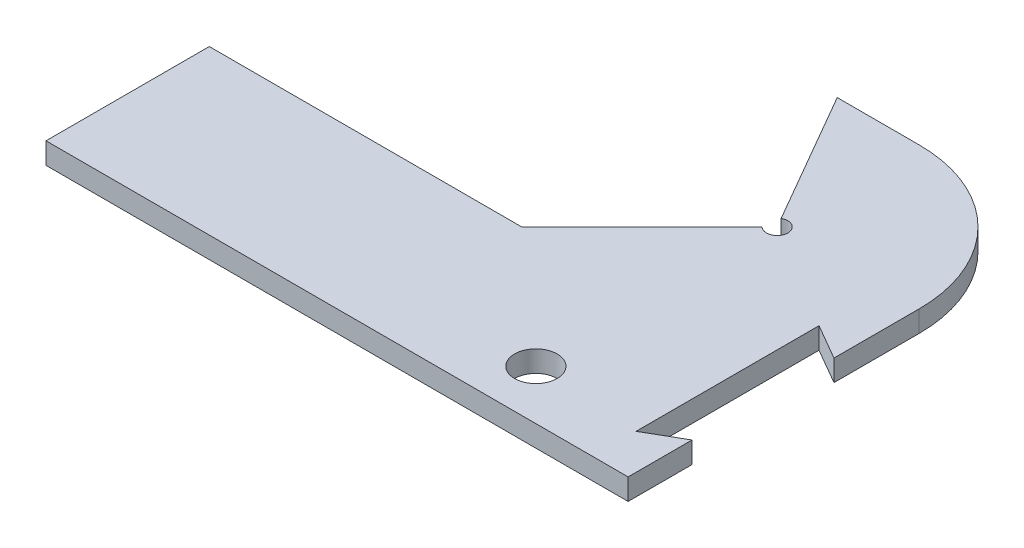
ISO-10303-21;
HEADER;
FILE_DESCRIPTION(('STEP AP214'),'2;1');
FILE_NAME('part.step','',(''),(''),'','','');
FILE_SCHEMA(('AUTOMOTIVE_DESIGN { 1 0 10303 214 1 1 1 1 }'));
ENDSEC;
DATA;
#1=APPLICATION_CONTEXT('core data for automotive mechanical design processes');
#2=APPLICATION_PROTOCOL_DEFINITION('international standard','automotive_design',2000,#1);
#3=PRODUCT_CONTEXT('',#1,'mechanical');
#4=PRODUCT('Part','Part','',(#3));
#5=PRODUCT_RELATED_PRODUCT_CATEGORY('part','',(#4));
#6=PRODUCT_DEFINITION_FORMATION('','',#4);
#7=PRODUCT_DEFINITION_CONTEXT('part definition',#1,'design');
#8=PRODUCT_DEFINITION('design','',#6,#7);
#9=PRODUCT_DEFINITION_SHAPE('','',#8);
#10=(LENGTH_UNIT() NAMED_UNIT(*) SI_UNIT(.MILLI.,.METRE.));
#11=(NAMED_UNIT(*) PLANE_ANGLE_UNIT() SI_UNIT($,.RADIAN.));
#12=(NAMED_UNIT(*) SI_UNIT($,.STERADIAN.) SOLID_ANGLE_UNIT());
#13=UNCERTAINTY_MEASURE_WITH_UNIT(LENGTH_MEASURE(1.E-05),#10,'distance_accuracy_value','');
#14=(GEOMETRIC_REPRESENTATION_CONTEXT(3) GLOBAL_UNCERTAINTY_ASSIGNED_CONTEXT((#13)) GLOBAL_UNIT_ASSIGNED_CONTEXT((#10,
#11,#12)) REPRESENTATION_CONTEXT('',''));
#15=CARTESIAN_POINT('',(0.,0.,0.));
#16=DIRECTION('',(0.,0.,1.));
#17=DIRECTION('',(1.,0.,0.));
#18=AXIS2_PLACEMENT_3D('',#15,#16,#17);
#19=CARTESIAN_POINT('',(62.,3.,-41.));
#20=DIRECTION('',(0.,1.,0.));
#21=DIRECTION('',(0.,0.,1.));
#22=AXIS2_PLACEMENT_3D('',#19,#20,#21);
#23=PLANE('',#22);
#24=DIRECTION('',(0.,0.,1.));
#25=VECTOR('',#24,1.);
#26=CARTESIAN_POINT('',(0.,3.,0.));
#27=LINE('',#26,#25);
#28=CARTESIAN_POINT('',(0.,3.,-23.));
#29=VERTEX_POINT('',#28);
#30=CARTESIAN_POINT('',(0.,3.,0.));
#31=VERTEX_POINT('',#30);
#32=EDGE_CURVE('E172',#29,#31,#27,.T.);
#33=ORIENTED_EDGE('',*,*,#32,.T.);
#34=DIRECTION('',(1.,0.,0.));
#35=VECTOR('',#34,1.);
#36=CARTESIAN_POINT('',(0.,3.,0.));
#37=LINE('',#36,#35);
#38=CARTESIAN_POINT('',(82.,3.,0.));
#39=VERTEX_POINT('',#38);
#40=EDGE_CURVE('E139',#31,#39,#37,.T.);
#41=ORIENTED_EDGE('',*,*,#40,.T.);
#42=DIRECTION('',(0.,0.,-1.));
#43=VECTOR('',#42,1.);
#44=CARTESIAN_POINT('',(82.,3.,0.));
#45=LINE('',#44,#43);
#46=CARTESIAN_POINT('',(82.,3.,-9.));
#47=VERTEX_POINT('',#46);
#48=EDGE_CURVE('E175',#39,#47,#45,.T.);
#49=ORIENTED_EDGE('',*,*,#48,.T.);
#50=DIRECTION('',(-0.866025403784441,0.,0.499999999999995));
#51=VECTOR('',#50,1.);
#52=CARTESIAN_POINT('',(82.,3.,-9.));
#53=LINE('',#52,#51);
#54=CARTESIAN_POINT('',(77.,3.,-6.11324865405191));
#55=VERTEX_POINT('',#54);
#56=EDGE_CURVE('E177',#47,#55,#53,.T.);
#57=ORIENTED_EDGE('',*,*,#56,.T.);
#58=DIRECTION('',(0.,0.,-1.));
#59=VECTOR('',#58,1.);
#60=CARTESIAN_POINT('',(77.,3.,-6.11324865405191));
#61=LINE('',#60,#59);
#62=CARTESIAN_POINT('',(77.,3.,-31.8867513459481));
#63=VERTEX_POINT('',#62);
#64=EDGE_CURVE('E179',#55,#63,#61,.T.);
#65=ORIENTED_EDGE('',*,*,#64,.T.);
#66=DIRECTION('',(0.866025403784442,0.,0.499999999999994));
#67=VECTOR('',#66,1.);
#68=CARTESIAN_POINT('',(82.,3.,-29.));
#69=LINE('',#68,#67);
#70=CARTESIAN_POINT('',(82.,3.,-29.));
#71=VERTEX_POINT('',#70);
#72=EDGE_CURVE('E181',#63,#71,#69,.T.);
#73=ORIENTED_EDGE('',*,*,#72,.T.);
#74=DIRECTION('',(0.,0.,-1.));
#75=VECTOR('',#74,1.);
#76=CARTESIAN_POINT('',(82.,3.,-29.));
#77=LINE('',#76,#75);
#78=CARTESIAN_POINT('',(82.,3.,-41.));
#79=VERTEX_POINT('',#78);
#80=EDGE_CURVE('E183',#71,#79,#77,.T.);
#81=ORIENTED_EDGE('',*,*,#80,.T.);
#82=CARTESIAN_POINT('',(62.,3.,-41.));
#83=DIRECTION('',(0.,1.,0.));
#84=DIRECTION('',(0.,0.,1.));
#85=AXIS2_PLACEMENT_3D('',#82,#83,#84);
#86=CIRCLE('',#85,20.);
#87=CARTESIAN_POINT('',(62.,3.,-61.));
#88=VERTEX_POINT('',#87);
#89=EDGE_CURVE('E185',#79,#88,#86,.T.);
#90=ORIENTED_EDGE('',*,*,#89,.T.);
#91=DIRECTION('',(-1.,0.,0.));
#92=VECTOR('',#91,1.);
#93=CARTESIAN_POINT('',(50.4529946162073,3.,-61.));
#94=LINE('',#93,#92);
#95=CARTESIAN_POINT('',(50.4529946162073,3.,-61.));
#96=VERTEX_POINT('',#95);
#97=EDGE_CURVE('E187',#88,#96,#94,.T.);
#98=ORIENTED_EDGE('',*,*,#97,.T.);
#99=DIRECTION('',(0.500000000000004,0.,0.866025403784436));
#100=VECTOR('',#99,1.);
#101=CARTESIAN_POINT('',(61.25,3.,-42.2990381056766));
#102=LINE('',#101,#100);
#103=CARTESIAN_POINT('',(61.25,3.,-42.2990381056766));
#104=VERTEX_POINT('',#103);
#105=EDGE_CURVE('E189',#96,#104,#102,.T.);
#106=ORIENTED_EDGE('',*,*,#105,.T.);
#107=CARTESIAN_POINT('',(62.,3.,-41.));
#108=DIRECTION('',(0.,-1.,0.));
#109=DIRECTION('',(0.,0.,1.));
#110=AXIS2_PLACEMENT_3D('',#107,#108,#109);
#111=CIRCLE('',#110,1.5);
#112=CARTESIAN_POINT('',(60.9393398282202,3.,-39.9393398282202));
#113=VERTEX_POINT('',#112);
#114=EDGE_CURVE('E191',#104,#113,#111,.T.);
#115=ORIENTED_EDGE('',*,*,#114,.T.);
#116=DIRECTION('',(-0.707106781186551,0.,0.707106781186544));
#117=VECTOR('',#116,1.);
#118=CARTESIAN_POINT('',(60.9393398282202,3.,-39.9393398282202));
#119=LINE('',#118,#117);
#120=CARTESIAN_POINT('',(43.9999999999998,3.,-23.));
#121=VERTEX_POINT('',#120);
#122=EDGE_CURVE('E50',#113,#121,#119,.T.);
#123=ORIENTED_EDGE('',*,*,#122,.T.);
#124=DIRECTION('',(-1.,0.,0.));
#125=VECTOR('',#124,1.);
#126=CARTESIAN_POINT('',(0.,3.,-23.));
#127=LINE('',#126,#125);
#128=EDGE_CURVE('E45',#121,#29,#127,.T.);
#129=ORIENTED_EDGE('',*,*,#128,.T.);
#130=EDGE_LOOP('',(#33,#41,#49,#57,#65,#73,#81,#90,#98,#106,#115,#123,#129));
#131=FACE_BOUND('',#130,.T.);
#132=CARTESIAN_POINT('',(62.,3.,-7.));
#133=DIRECTION('',(0.,1.,0.));
#134=DIRECTION('',(0.,0.,1.));
#135=AXIS2_PLACEMENT_3D('',#132,#133,#134);
#136=CIRCLE('',#135,3.);
#137=CARTESIAN_POINT('',(62.,3.,-4.));
#138=VERTEX_POINT('',#137);
#139=EDGE_CURVE('E144',#138,#138,#136,.T.);
#140=ORIENTED_EDGE('',*,*,#139,.F.);
#141=EDGE_LOOP('',(#140));
#142=FACE_BOUND('',#141,.T.);
#143=ADVANCED_FACE('F30',(#131,#142),#23,.T.);
#144=CARTESIAN_POINT('',(62.,0.,-41.));
#145=DIRECTION('',(0.,1.,0.));
#146=DIRECTION('',(0.,0.,1.));
#147=AXIS2_PLACEMENT_3D('',#144,#145,#146);
#148=PLANE('',#147);
#149=DIRECTION('',(0.,0.,1.));
#150=VECTOR('',#149,1.);
#151=CARTESIAN_POINT('',(0.,0.,0.));
#152=LINE('',#151,#150);
#153=CARTESIAN_POINT('',(0.,0.,-23.));
#154=VERTEX_POINT('',#153);
#155=CARTESIAN_POINT('',(0.,0.,0.));
#156=VERTEX_POINT('',#155);
#157=EDGE_CURVE('E130',#154,#156,#152,.T.);
#158=ORIENTED_EDGE('',*,*,#157,.F.);
#159=DIRECTION('',(-1.,0.,0.));
#160=VECTOR('',#159,1.);
#161=CARTESIAN_POINT('',(0.,0.,-23.));
#162=LINE('',#161,#160);
#163=CARTESIAN_POINT('',(43.9999999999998,0.,-23.));
#164=VERTEX_POINT('',#163);
#165=EDGE_CURVE('E170',#164,#154,#162,.T.);
#166=ORIENTED_EDGE('',*,*,#165,.F.);
#167=DIRECTION('',(-0.707106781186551,0.,0.707106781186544));
#168=VECTOR('',#167,1.);
#169=CARTESIAN_POINT('',(60.9393398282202,0.,-39.9393398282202));
#170=LINE('',#169,#168);
#171=CARTESIAN_POINT('',(60.9393398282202,0.,-39.9393398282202));
#172=VERTEX_POINT('',#171);
#173=EDGE_CURVE('E168',#172,#164,#170,.T.);
#174=ORIENTED_EDGE('',*,*,#173,.F.);
#175=CARTESIAN_POINT('',(62.,0.,-41.));
#176=DIRECTION('',(0.,-1.,0.));
#177=DIRECTION('',(0.,0.,1.));
#178=AXIS2_PLACEMENT_3D('',#175,#176,#177);
#179=CIRCLE('',#178,1.5);
#180=CARTESIAN_POINT('',(61.25,0.,-42.2990381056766));
#181=VERTEX_POINT('',#180);
#182=EDGE_CURVE('E166',#181,#172,#179,.T.);
#183=ORIENTED_EDGE('',*,*,#182,.F.);
#184=DIRECTION('',(0.500000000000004,0.,0.866025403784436));
#185=VECTOR('',#184,1.);
#186=CARTESIAN_POINT('',(61.25,0.,-42.2990381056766));
#187=LINE('',#186,#185);
#188=CARTESIAN_POINT('',(50.4529946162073,0.,-61.));
#189=VERTEX_POINT('',#188);
#190=EDGE_CURVE('E164',#189,#181,#187,.T.);
#191=ORIENTED_EDGE('',*,*,#190,.F.);
#192=DIRECTION('',(-1.,0.,0.));
#193=VECTOR('',#192,1.);
#194=CARTESIAN_POINT('',(50.4529946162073,0.,-61.));
#195=LINE('',#194,#193);
#196=CARTESIAN_POINT('',(62.,0.,-61.));
#197=VERTEX_POINT('',#196);
#198=EDGE_CURVE('E162',#197,#189,#195,.T.);
#199=ORIENTED_EDGE('',*,*,#198,.F.);
#200=CARTESIAN_POINT('',(62.,0.,-41.));
#201=DIRECTION('',(0.,1.,0.));
#202=DIRECTION('',(0.,0.,1.));
#203=AXIS2_PLACEMENT_3D('',#200,#201,#202);
#204=CIRCLE('',#203,20.);
#205=CARTESIAN_POINT('',(82.,0.,-41.));
#206=VERTEX_POINT('',#205);
#207=EDGE_CURVE('E160',#206,#197,#204,.T.);
#208=ORIENTED_EDGE('',*,*,#207,.F.);
#209=DIRECTION('',(0.,0.,-1.));
#210=VECTOR('',#209,1.);
#211=CARTESIAN_POINT('',(82.,0.,-29.));
#212=LINE('',#211,#210);
#213=CARTESIAN_POINT('',(82.,0.,-29.));
#214=VERTEX_POINT('',#213);
#215=EDGE_CURVE('E158',#214,#206,#212,.T.);
#216=ORIENTED_EDGE('',*,*,#215,.F.);
#217=DIRECTION('',(0.866025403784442,0.,0.499999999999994));
#218=VECTOR('',#217,1.);
#219=CARTESIAN_POINT('',(82.,0.,-29.));
#220=LINE('',#219,#218);
#221=CARTESIAN_POINT('',(77.,0.,-31.8867513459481));
#222=VERTEX_POINT('',#221);
#223=EDGE_CURVE('E156',#222,#214,#220,.T.);
#224=ORIENTED_EDGE('',*,*,#223,.F.);
#225=DIRECTION('',(0.,0.,-1.));
#226=VECTOR('',#225,1.);
#227=CARTESIAN_POINT('',(77.,0.,-6.11324865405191));
#228=LINE('',#227,#226);
#229=CARTESIAN_POINT('',(77.,0.,-6.11324865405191));
#230=VERTEX_POINT('',#229);
#231=EDGE_CURVE('E154',#230,#222,#228,.T.);
#232=ORIENTED_EDGE('',*,*,#231,.F.);
#233=DIRECTION('',(-0.866025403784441,0.,0.499999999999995));
#234=VECTOR('',#233,1.);
#235=CARTESIAN_POINT('',(82.,0.,-9.));
#236=LINE('',#235,#234);
#237=CARTESIAN_POINT('',(82.,0.,-9.));
#238=VERTEX_POINT('',#237);
#239=EDGE_CURVE('E152',#238,#230,#236,.T.);
#240=ORIENTED_EDGE('',*,*,#239,.F.);
#241=DIRECTION('',(0.,0.,-1.));
#242=VECTOR('',#241,1.);
#243=CARTESIAN_POINT('',(82.,0.,0.));
#244=LINE('',#243,#242);
#245=CARTESIAN_POINT('',(82.,0.,0.));
#246=VERTEX_POINT('',#245);
#247=EDGE_CURVE('E132',#246,#238,#244,.T.);
#248=ORIENTED_EDGE('',*,*,#247,.F.);
#249=DIRECTION('',(1.,0.,0.));
#250=VECTOR('',#249,1.);
#251=CARTESIAN_POINT('',(0.,0.,0.));
#252=LINE('',#251,#250);
#253=EDGE_CURVE('E125',#156,#246,#252,.T.);
#254=ORIENTED_EDGE('',*,*,#253,.F.);
#255=EDGE_LOOP('',(#158,#166,#174,#183,#191,#199,#208,#216,#224,#232,#240,#248,#254));
#256=FACE_BOUND('',#255,.T.);
#257=CARTESIAN_POINT('',(62.,0.,-7.));
#258=DIRECTION('',(0.,1.,0.));
#259=DIRECTION('',(0.,0.,1.));
#260=AXIS2_PLACEMENT_3D('',#257,#258,#259);
#261=CIRCLE('',#260,3.);
#262=CARTESIAN_POINT('',(62.,0.,-4.));
#263=VERTEX_POINT('',#262);
#264=EDGE_CURVE('E147',#263,#263,#261,.T.);
#265=ORIENTED_EDGE('',*,*,#264,.T.);
#266=EDGE_LOOP('',(#265));
#267=FACE_BOUND('',#266,.T.);
#268=ADVANCED_FACE('F126',(#256,#267),#148,.F.);
#269=CARTESIAN_POINT('',(0.,3.,0.));
#270=DIRECTION('',(1.,0.,0.));
#271=DIRECTION('',(0.,0.,-1.));
#272=AXIS2_PLACEMENT_3D('',#269,#270,#271);
#273=PLANE('',#272);
#274=ORIENTED_EDGE('',*,*,#157,.T.);
#275=DIRECTION('',(0.,-1.,0.));
#276=VECTOR('',#275,1.);
#277=CARTESIAN_POINT('',(0.,3.,0.));
#278=LINE('',#277,#276);
#279=EDGE_CURVE('E11',#31,#156,#278,.T.);
#280=ORIENTED_EDGE('',*,*,#279,.F.);
#281=ORIENTED_EDGE('',*,*,#32,.F.);
#282=DIRECTION('',(0.,-1.,0.));
#283=VECTOR('',#282,1.);
#284=CARTESIAN_POINT('',(0.,3.,-23.));
#285=LINE('',#284,#283);
#286=EDGE_CURVE('E143',#29,#154,#285,.T.);
#287=ORIENTED_EDGE('',*,*,#286,.T.);
#288=EDGE_LOOP('',(#274,#280,#281,#287));
#289=FACE_BOUND('',#288,.T.);
#290=ADVANCED_FACE('F32',(#289),#273,.F.);
#291=CARTESIAN_POINT('',(0.,3.,0.));
#292=DIRECTION('',(0.,0.,-1.));
#293=DIRECTION('',(-1.,0.,0.));
#294=AXIS2_PLACEMENT_3D('',#291,#292,#293);
#295=PLANE('',#294);
#296=ORIENTED_EDGE('',*,*,#253,.T.);
#297=DIRECTION('',(0.,-1.,0.));
#298=VECTOR('',#297,1.);
#299=CARTESIAN_POINT('',(82.,3.,0.));
#300=LINE('',#299,#298);
#301=EDGE_CURVE('E38',#39,#246,#300,.T.);
#302=ORIENTED_EDGE('',*,*,#301,.F.);
#303=ORIENTED_EDGE('',*,*,#40,.F.);
#304=ORIENTED_EDGE('',*,*,#279,.T.);
#305=EDGE_LOOP('',(#296,#302,#303,#304));
#306=FACE_BOUND('',#305,.T.);
#307=ADVANCED_FACE('F138',(#306),#295,.F.);
#308=CARTESIAN_POINT('',(82.,3.,0.));
#309=DIRECTION('',(-1.,0.,0.));
#310=DIRECTION('',(0.,0.,1.));
#311=AXIS2_PLACEMENT_3D('',#308,#309,#310);
#312=PLANE('',#311);
#313=ORIENTED_EDGE('',*,*,#247,.T.);
#314=DIRECTION('',(0.,-1.,0.));
#315=VECTOR('',#314,1.);
#316=CARTESIAN_POINT('',(82.,3.,-9.));
#317=LINE('',#316,#315);
#318=EDGE_CURVE('E223',#47,#238,#317,.T.);
#319=ORIENTED_EDGE('',*,*,#318,.F.);
#320=ORIENTED_EDGE('',*,*,#48,.F.);
#321=ORIENTED_EDGE('',*,*,#301,.T.);
#322=EDGE_LOOP('',(#313,#319,#320,#321));
#323=FACE_BOUND('',#322,.T.);
#324=ADVANCED_FACE('F227',(#323),#312,.F.);
#325=CARTESIAN_POINT('',(82.,3.,-9.));
#326=DIRECTION('',(0.499999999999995,0.,0.866025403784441));
#327=DIRECTION('',(0.866025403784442,0.,-0.499999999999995));
#328=AXIS2_PLACEMENT_3D('',#325,#326,#327);
#329=PLANE('',#328);
#330=ORIENTED_EDGE('',*,*,#239,.T.);
#331=DIRECTION('',(0.,-1.,0.));
#332=VECTOR('',#331,1.);
#333=CARTESIAN_POINT('',(77.,3.,-6.11324865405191));
#334=LINE('',#333,#332);
#335=EDGE_CURVE('E220',#55,#230,#334,.T.);
#336=ORIENTED_EDGE('',*,*,#335,.F.);
#337=ORIENTED_EDGE('',*,*,#56,.F.);
#338=ORIENTED_EDGE('',*,*,#318,.T.);
#339=EDGE_LOOP('',(#330,#336,#337,#338));
#340=FACE_BOUND('',#339,.T.);
#341=ADVANCED_FACE('F235',(#340),#329,.F.);
#342=CARTESIAN_POINT('',(77.,3.,-6.11324865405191));
#343=DIRECTION('',(-1.,0.,0.));
#344=DIRECTION('',(0.,0.,1.));
#345=AXIS2_PLACEMENT_3D('',#342,#343,#344);
#346=PLANE('',#345);
#347=ORIENTED_EDGE('',*,*,#231,.T.);
#348=DIRECTION('',(0.,-1.,0.));
#349=VECTOR('',#348,1.);
#350=CARTESIAN_POINT('',(77.,3.,-31.8867513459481));
#351=LINE('',#350,#349);
#352=EDGE_CURVE('E217',#63,#222,#351,.T.);
#353=ORIENTED_EDGE('',*,*,#352,.F.);
#354=ORIENTED_EDGE('',*,*,#64,.F.);
#355=ORIENTED_EDGE('',*,*,#335,.T.);
#356=EDGE_LOOP('',(#347,#353,#354,#355));
#357=FACE_BOUND('',#356,.T.);
#358=ADVANCED_FACE('F238',(#357),#346,.F.);
#359=CARTESIAN_POINT('',(82.,3.,-29.));
#360=DIRECTION('',(0.499999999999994,0.,-0.866025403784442));
#361=DIRECTION('',(-0.866025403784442,0.,-0.499999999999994));
#362=AXIS2_PLACEMENT_3D('',#359,#360,#361);
#363=PLANE('',#362);
#364=ORIENTED_EDGE('',*,*,#223,.T.);
#365=DIRECTION('',(0.,-1.,0.));
#366=VECTOR('',#365,1.);
#367=CARTESIAN_POINT('',(82.,3.,-29.));
#368=LINE('',#367,#366);
#369=EDGE_CURVE('E214',#71,#214,#368,.T.);
#370=ORIENTED_EDGE('',*,*,#369,.F.);
#371=ORIENTED_EDGE('',*,*,#72,.F.);
#372=ORIENTED_EDGE('',*,*,#352,.T.);
#373=EDGE_LOOP('',(#364,#370,#371,#372));
#374=FACE_BOUND('',#373,.T.);
#375=ADVANCED_FACE('F243',(#374),#363,.F.);
#376=CARTESIAN_POINT('',(82.,3.,-29.));
#377=DIRECTION('',(-1.,0.,0.));
#378=DIRECTION('',(0.,0.,1.));
#379=AXIS2_PLACEMENT_3D('',#376,#377,#378);
#380=PLANE('',#379);
#381=ORIENTED_EDGE('',*,*,#215,.T.);
#382=DIRECTION('',(0.,-1.,0.));
#383=VECTOR('',#382,1.);
#384=CARTESIAN_POINT('',(82.,3.,-41.));
#385=LINE('',#384,#383);
#386=EDGE_CURVE('E211',#79,#206,#385,.T.);
#387=ORIENTED_EDGE('',*,*,#386,.F.);
#388=ORIENTED_EDGE('',*,*,#80,.F.);
#389=ORIENTED_EDGE('',*,*,#369,.T.);
#390=EDGE_LOOP('',(#381,#387,#388,#389));
#391=FACE_BOUND('',#390,.T.);
#392=ADVANCED_FACE('F249',(#391),#380,.F.);
#393=CARTESIAN_POINT('',(62.,3.,-41.));
#394=DIRECTION('',(0.,-1.,0.));
#395=DIRECTION('',(0.,0.,-1.));
#396=AXIS2_PLACEMENT_3D('',#393,#394,#395);
#397=CYLINDRICAL_SURFACE('',#396,20.);
#398=ORIENTED_EDGE('',*,*,#207,.T.);
#399=DIRECTION('',(0.,-1.,0.));
#400=VECTOR('',#399,1.);
#401=CARTESIAN_POINT('',(62.,3.,-61.));
#402=LINE('',#401,#400);
#403=EDGE_CURVE('E208',#88,#197,#402,.T.);
#404=ORIENTED_EDGE('',*,*,#403,.F.);
#405=ORIENTED_EDGE('',*,*,#89,.F.);
#406=ORIENTED_EDGE('',*,*,#386,.T.);
#407=EDGE_LOOP('',(#398,#404,#405,#406));
#408=FACE_BOUND('',#407,.T.);
#409=ADVANCED_FACE('F253',(#408),#397,.T.);
#410=CARTESIAN_POINT('',(50.4529946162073,3.,-61.));
#411=DIRECTION('',(0.,0.,1.));
#412=DIRECTION('',(1.,0.,0.));
#413=AXIS2_PLACEMENT_3D('',#410,#411,#412);
#414=PLANE('',#413);
#415=ORIENTED_EDGE('',*,*,#198,.T.);
#416=DIRECTION('',(0.,-1.,0.));
#417=VECTOR('',#416,1.);
#418=CARTESIAN_POINT('',(50.4529946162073,3.,-61.));
#419=LINE('',#418,#417);
#420=EDGE_CURVE('E205',#96,#189,#419,.T.);
#421=ORIENTED_EDGE('',*,*,#420,.F.);
#422=ORIENTED_EDGE('',*,*,#97,.F.);
#423=ORIENTED_EDGE('',*,*,#403,.T.);
#424=EDGE_LOOP('',(#415,#421,#422,#423));
#425=FACE_BOUND('',#424,.T.);
#426=ADVANCED_FACE('F258',(#425),#414,.F.);
#427=CARTESIAN_POINT('',(61.25,3.,-42.2990381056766));
#428=DIRECTION('',(0.866025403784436,0.,-0.500000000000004));
#429=DIRECTION('',(-0.500000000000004,0.,-0.866025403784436));
#430=AXIS2_PLACEMENT_3D('',#427,#428,#429);
#431=PLANE('',#430);
#432=ORIENTED_EDGE('',*,*,#190,.T.);
#433=DIRECTION('',(0.,-1.,0.));
#434=VECTOR('',#433,1.);
#435=CARTESIAN_POINT('',(61.25,3.,-42.2990381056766));
#436=LINE('',#435,#434);
#437=EDGE_CURVE('E202',#104,#181,#436,.T.);
#438=ORIENTED_EDGE('',*,*,#437,.F.);
#439=ORIENTED_EDGE('',*,*,#105,.F.);
#440=ORIENTED_EDGE('',*,*,#420,.T.);
#441=EDGE_LOOP('',(#432,#438,#439,#440));
#442=FACE_BOUND('',#441,.T.);
#443=ADVANCED_FACE('F264',(#442),#431,.F.);
#444=CARTESIAN_POINT('',(62.,3.,-41.));
#445=DIRECTION('',(0.,-1.,0.));
#446=DIRECTION('',(0.,0.,-1.));
#447=AXIS2_PLACEMENT_3D('',#444,#445,#446);
#448=CYLINDRICAL_SURFACE('',#447,1.5);
#449=ORIENTED_EDGE('',*,*,#182,.T.);
#450=DIRECTION('',(0.,-1.,0.));
#451=VECTOR('',#450,1.);
#452=CARTESIAN_POINT('',(60.9393398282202,3.,-39.9393398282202));
#453=LINE('',#452,#451);
#454=EDGE_CURVE('E199',#113,#172,#453,.T.);
#455=ORIENTED_EDGE('',*,*,#454,.F.);
#456=ORIENTED_EDGE('',*,*,#114,.F.);
#457=ORIENTED_EDGE('',*,*,#437,.T.);
#458=EDGE_LOOP('',(#449,#455,#456,#457));
#459=FACE_BOUND('',#458,.T.);
#460=ADVANCED_FACE('F268',(#459),#448,.F.);
#461=CARTESIAN_POINT('',(60.9393398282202,3.,-39.9393398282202));
#462=DIRECTION('',(0.707106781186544,0.,0.707106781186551));
#463=DIRECTION('',(0.707106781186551,0.,-0.707106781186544));
#464=AXIS2_PLACEMENT_3D('',#461,#462,#463);
#465=PLANE('',#464);
#466=ORIENTED_EDGE('',*,*,#173,.T.);
#467=DIRECTION('',(0.,-1.,0.));
#468=VECTOR('',#467,1.);
#469=CARTESIAN_POINT('',(43.9999999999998,3.,-23.));
#470=LINE('',#469,#468);
#471=EDGE_CURVE('E196',#121,#164,#470,.T.);
#472=ORIENTED_EDGE('',*,*,#471,.F.);
#473=ORIENTED_EDGE('',*,*,#122,.F.);
#474=ORIENTED_EDGE('',*,*,#454,.T.);
#475=EDGE_LOOP('',(#466,#472,#473,#474));
#476=FACE_BOUND('',#475,.T.);
#477=ADVANCED_FACE('F271',(#476),#465,.F.);
#478=CARTESIAN_POINT('',(0.,3.,-23.));
#479=DIRECTION('',(0.,0.,1.));
#480=DIRECTION('',(1.,0.,0.));
#481=AXIS2_PLACEMENT_3D('',#478,#479,#480);
#482=PLANE('',#481);
#483=ORIENTED_EDGE('',*,*,#165,.T.);
#484=ORIENTED_EDGE('',*,*,#286,.F.);
#485=ORIENTED_EDGE('',*,*,#128,.F.);
#486=ORIENTED_EDGE('',*,*,#471,.T.);
#487=EDGE_LOOP('',(#483,#484,#485,#486));
#488=FACE_BOUND('',#487,.T.);
#489=ADVANCED_FACE('F273',(#488),#482,.F.);
#490=CARTESIAN_POINT('',(62.,3.,-7.));
#491=DIRECTION('',(0.,-1.,0.));
#492=DIRECTION('',(0.,0.,-1.));
#493=AXIS2_PLACEMENT_3D('',#490,#491,#492);
#494=CYLINDRICAL_SURFACE('',#493,3.);
#495=ORIENTED_EDGE('',*,*,#139,.T.);
#496=EDGE_LOOP('',(#495));
#497=FACE_BOUND('',#496,.T.);
#498=ORIENTED_EDGE('',*,*,#264,.F.);
#499=EDGE_LOOP('',(#498));
#500=FACE_BOUND('',#499,.T.);
#501=ADVANCED_FACE('F275',(#497,#500),#494,.F.);
#502=CLOSED_SHELL('',(#143,#268,#290,#307,#324,#341,#358,#375,#392,#409,#426,#443,#460,#477,
#489,#501));
#503=MANIFOLD_SOLID_BREP('B2',#502);
#504=ADVANCED_BREP_SHAPE_REPRESENTATION('',(#18,#503),#14);
#505=SHAPE_DEFINITION_REPRESENTATION(#9,#504);
ENDSEC;
END-ISO-10303-21;
